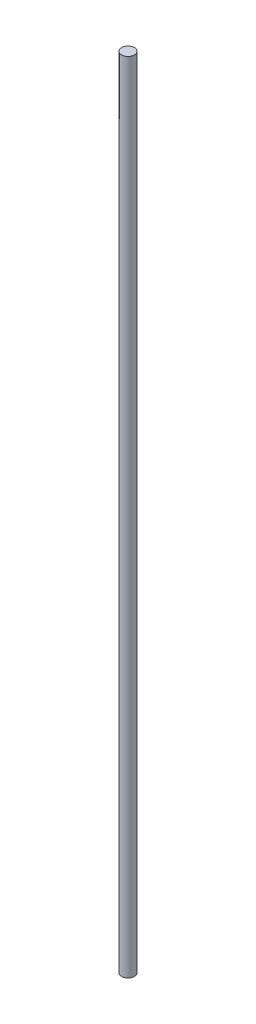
from build123d import *

# Parameters (mm, degrees)
SKETCH_1_R      = 1.5
EXTRUDE_1_DEPTH = 187


with BuildPart() as part:
    # Sketch 1 → Extrude 1 (new body)
    with BuildSketch(Plane(origin=(0, 0, 0), x_dir=(1, 0, 0), z_dir=(0, 1, 0))):
        with Locations(Location((0, 0, 0), (0, 0, 270))):
            Circle(SKETCH_1_R)
    extrude(amount=EXTRUDE_1_DEPTH)


solid = part.part
